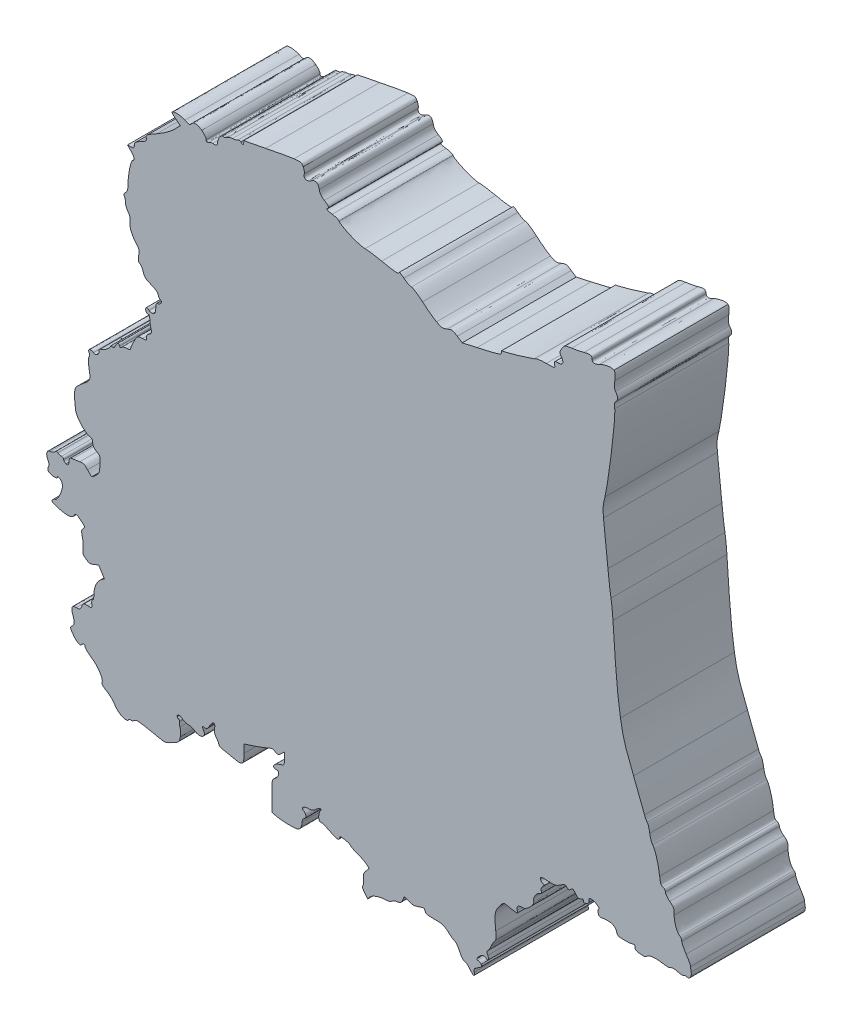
from build123d import *

# Parameters (mm, degrees)
BOSS_EXTRU_7_DEPTH = 5


with BuildPart() as part:
    # Esquisse1 → Boss.-Extru.7 (new body)
    with BuildSketch(Plane(origin=(0, 0, 0), x_dir=(0, 1, 0), z_dir=(0, 0, 1))):
        with BuildLine():
            Line((-281.19316, -2.65401), (-281.31302, -2.55851))
            Line((-281.31302, -2.55851), (-281.14699, -2.42385))
            add(Edge.make_bspline(
                [(-281.14699, -2.42385), (-281.02687, -2.32645), (-280.96172, -2.30516), (-280.91132, -2.34665)],
                knots=[0, 0, 0, 0, 1, 1, 1, 1], degree=3))
            add(Edge.make_bspline(
                [(-280.91132, -2.34665), (-280.87292, -2.37835), (-280.75476, -2.39005), (-280.64853, -2.37285)],
                knots=[0, 0, 0, 0, 1, 1, 1, 1], degree=3))
            add(Edge.make_bspline(
                [(-280.64853, -2.37285), (-280.49438, -2.34795), (-280.42175, -2.37085), (-280.2887, -2.48178)],
                knots=[0, 0, 0, 0, 1, 1, 1, 1], degree=3))
            Line((-280.2887, -2.48178), (-280.12199, -2.62204))
            Line((-280.12199, -2.62204), (-280.0138, -2.49211))
            add(Edge.make_bspline(
                [(-280.0138, -2.49211), (-279.9543, -2.42061), (-279.86541, -2.24404), (-279.81633, -2.09964)],
                knots=[0, 0, 0, 0, 1, 1, 1, 1], degree=3))
            add(Edge.make_bspline(
                [(-279.81633, -2.09964), (-279.76723, -1.95524), (-279.69478, -1.81826), (-279.65538, -1.79526)],
                knots=[0, 0, 0, 0, 1, 1, 1, 1], degree=3))
            add(Edge.make_bspline(
                [(-279.65538, -1.79526), (-279.58588, -1.75466), (-279.50572, -1.33923), (-279.56698, -1.33751)],
                knots=[0, 0, 0, 0, 1, 1, 1, 1], degree=3))
            add(Edge.make_bspline(
                [(-279.56698, -1.33751), (-279.58368, -1.3371), (-279.63058, -1.31561), (-279.67129, -1.28981)],
                knots=[0, 0, 0, 0, 1, 1, 1, 1], degree=3))
            add(Edge.make_bspline(
                [(-279.67129, -1.28981), (-279.72989, -1.25261), (-279.70919, -1.17164), (-279.57073, -0.89752)],
                knots=[0, 0, 0, 0, 1, 1, 1, 1], degree=3))
            add(Edge.make_bspline(
                [(-279.57073, -0.89752), (-279.47483, -0.70749), (-279.409, -0.51896), (-279.4245, -0.47854)],
                knots=[0, 0, 0, 0, 1, 1, 1, 1], degree=3))
            add(Edge.make_bspline(
                [(-279.4245, -0.47854), (-279.4586, -0.38964), (-279.13836, -0.38114), (-279.02884, -0.46794)],
                knots=[0, 0, 0, 0, 1, 1, 1, 1], degree=3))
            add(Edge.make_bspline(
                [(-279.02884, -0.46794), (-278.8864, -0.58098), (-278.89061, -0.44674), (-279.03384, -0.29697)],
                knots=[0, 0, 0, 0, 1, 1, 1, 1], degree=3))
            add(Edge.make_bspline(
                [(-279.03384, -0.29697), (-279.13828, -0.18803), (-279.18199, -0.08367), (-279.18199, 0.05626)],
                knots=[0, 0, 0, 0, 1, 1, 1, 1], degree=3))
            add(Edge.make_bspline(
                [(-279.18199, 0.05626), (-279.18199, 0.26501), (-279.32418, 0.39319), (-279.38371, 0.23807)],
                knots=[0, 0, 0, 0, 1, 1, 1, 1], degree=3))
            add(Edge.make_bspline(
                [(-279.38371, 0.23807), (-279.42461, 0.13124), (-279.61899, 0.13195), (-279.66005, 0.23896)],
                knots=[0, 0, 0, 0, 1, 1, 1, 1], degree=3))
            add(Edge.make_bspline(
                [(-279.66005, 0.23896), (-279.67755, 0.28456), (-279.75835, 0.32206), (-279.8397, 0.32206)],
                knots=[0, 0, 0, 0, 1, 1, 1, 1], degree=3))
            add(Edge.make_bspline(
                [(-279.8397, 0.32206), (-279.9209, 0.32206), (-280.04046, 0.35916), (-280.1052, 0.40456)],
                knots=[0, 0, 0, 0, 1, 1, 1, 1], degree=3))
            add(Edge.make_bspline(
                [(-280.1052, 0.40456), (-280.20666, 0.47566), (-280.22312, 0.54243), (-280.22403, 0.88879)],
                knots=[0, 0, 0, 0, 1, 1, 1, 1], degree=3))
            add(Edge.make_bspline(
                [(-280.22403, 0.88879), (-280.22447, 1.10978), (-280.20023, 1.37153), (-280.16973, 1.47045)],
                knots=[0, 0, 0, 0, 1, 1, 1, 1], degree=3))
            Line((-280.16973, 1.47045), (-280.11423, 1.65032))
            Line((-280.11423, 1.65032), (-279.48845, 1.65032))
            add(Edge.make_bspline(
                [(-279.48845, 1.65032), (-278.89104, 1.65032), (-278.85878, 1.64332), (-278.77668, 1.51907)],
                knots=[0, 0, 0, 0, 1, 1, 1, 1], degree=3))
            add(Edge.make_bspline(
                [(-278.77668, 1.51907), (-278.72938, 1.44697), (-278.62689, 1.37561), (-278.54894, 1.36071)],
                knots=[0, 0, 0, 0, 1, 1, 1, 1], degree=3))
            add(Edge.make_bspline(
                [(-278.54894, 1.36071), (-278.43063, 1.33811), (-278.40721, 1.35371), (-278.40721, 1.45911)],
                knots=[0, 0, 0, 0, 1, 1, 1, 1], degree=3))
            add(Edge.make_bspline(
                [(-278.40721, 1.45911), (-278.40721, 1.6698), (-278.21087, 1.56475), (-278.13569, 1.31375)],
                knots=[0, 0, 0, 0, 1, 1, 1, 1], degree=3))
            add(Edge.make_bspline(
                [(-278.13569, 1.31375), (-278.07229, 1.10205), (-278.06459, 1.09689), (-277.81425, 1.09689)],
                knots=[0, 0, 0, 0, 1, 1, 1, 1], degree=3))
            Line((-277.81425, 1.09689), (-277.55778, 1.09689))
            Line((-277.55778, 1.09689), (-277.68757, 1.23505))
            add(Edge.make_bspline(
                [(-277.68757, 1.23505), (-277.80161, 1.35645), (-277.80886, 1.38908), (-277.74717, 1.50424)],
                knots=[0, 0, 0, 0, 1, 1, 1, 1], degree=3))
            add(Edge.make_bspline(
                [(-277.74717, 1.50424), (-277.68947, 1.61199), (-277.69127, 1.66356), (-277.75747, 1.79496)],
                knots=[0, 0, 0, 0, 1, 1, 1, 1], degree=3))
            add(Edge.make_bspline(
                [(-277.75747, 1.79496), (-277.80187, 1.88286), (-277.90596, 2.16016), (-277.98871, 2.41126)],
                knots=[0, 0, 0, 0, 1, 1, 1, 1], degree=3))
            Line((-277.98871, 2.41126), (-278.13916, 2.86784))
            Line((-278.13916, 2.86784), (-278.48756, 2.86784))
            add(Edge.make_bspline(
                [(-278.48756, 2.86784), (-278.9424, 2.86784), (-278.99888, 2.92914), (-278.90822, 3.32495)],
                knots=[0, 0, 0, 0, 1, 1, 1, 1], degree=3))
            add(Edge.make_bspline(
                [(-278.90822, 3.32495), (-278.87172, 3.48446), (-278.82842, 3.6959), (-278.81192, 3.79482)],
                knots=[0, 0, 0, 0, 1, 1, 1, 1], degree=3))
            add(Edge.make_bspline(
                [(-278.81192, 3.79482), (-278.79542, 3.89362), (-278.75072, 3.97468), (-278.71252, 3.97468)],
                knots=[0, 0, 0, 0, 1, 1, 1, 1], degree=3))
            add(Edge.make_bspline(
                [(-278.71252, 3.97468), (-278.67432, 3.97468), (-278.57988, 4.02428), (-278.50269, 4.08512)],
                knots=[0, 0, 0, 0, 1, 1, 1, 1], degree=3))
            add(Edge.make_bspline(
                [(-278.50269, 4.08512), (-278.40239, 4.16402), (-278.31533, 4.18619), (-278.19755, 4.16262)],
                knots=[0, 0, 0, 0, 1, 1, 1, 1], degree=3))
            add(Edge.make_bspline(
                [(-278.19755, 4.16262), (-277.9428, 4.11172), (-277.9373, 4.22942), (-278.18855, 4.37026)],
                knots=[0, 0, 0, 0, 1, 1, 1, 1], degree=3))
            add(Edge.make_bspline(
                [(-278.18855, 4.37026), (-278.35058, 4.46136), (-278.40677, 4.52474), (-278.38824, 4.59561)],
                knots=[0, 0, 0, 0, 1, 1, 1, 1], degree=3))
            add(Edge.make_bspline(
                [(-278.38824, 4.59561), (-278.35834, 4.7103), (-278.37524, 4.71535), (-278.52528, 4.63511)],
                knots=[0, 0, 0, 0, 1, 1, 1, 1], degree=3))
            add(Edge.make_bspline(
                [(-278.52528, 4.63511), (-278.75065, 4.51448), (-278.88575, 4.81846), (-278.71004, 5.05077)],
                knots=[0, 0, 0, 0, 1, 1, 1, 1], degree=3))
            add(Edge.make_bspline(
                [(-278.71004, 5.05077), (-278.66534, 5.10987), (-278.62874, 5.22339), (-278.62874, 5.30307)],
                knots=[0, 0, 0, 0, 1, 1, 1, 1], degree=3))
            add(Edge.make_bspline(
                [(-278.62874, 5.30307), (-278.62874, 5.38277), (-278.59214, 5.49628), (-278.54754, 5.55536)],
                knots=[0, 0, 0, 0, 1, 1, 1, 1], degree=3))
            add(Edge.make_bspline(
                [(-278.54754, 5.55536), (-278.44206, 5.69489), (-278.44128, 5.80114), (-278.54654, 5.80114)],
                knots=[0, 0, 0, 0, 1, 1, 1, 1], degree=3))
            add(Edge.make_bspline(
                [(-278.54654, 5.80114), (-278.59214, 5.80114), (-278.62964, 5.77404), (-278.62964, 5.74114)],
                knots=[0, 0, 0, 0, 1, 1, 1, 1], degree=3))
            add(Edge.make_bspline(
                [(-278.62964, 5.74114), (-278.62964, 5.70824), (-278.66074, 5.69214), (-278.69884, 5.70554)],
                knots=[0, 0, 0, 0, 1, 1, 1, 1], degree=3))
            add(Edge.make_bspline(
                [(-278.69884, 5.70554), (-278.73694, 5.71894), (-278.82816, 5.70754), (-278.90151, 5.68044)],
                knots=[0, 0, 0, 0, 1, 1, 1, 1], degree=3))
            add(Edge.make_bspline(
                [(-278.90151, 5.68044), (-278.97501, 5.65324), (-279.13847, 5.64644), (-279.26491, 5.66554)],
                knots=[0, 0, 0, 0, 1, 1, 1, 1], degree=3))
            add(Edge.make_bspline(
                [(-279.26491, 5.66554), (-279.47599, 5.69724), (-279.50859, 5.72564), (-279.66285, 6.01348)],
                knots=[0, 0, 0, 0, 1, 1, 1, 1], degree=3))
            add(Edge.make_bspline(
                [(-279.66285, 6.01348), (-279.80661, 6.28162), (-279.82365, 6.35494), (-279.78077, 6.52065)],
                knots=[0, 0, 0, 0, 1, 1, 1, 1], degree=3))
            add(Edge.make_bspline(
                [(-279.78077, 6.52065), (-279.75317, 6.62711), (-279.69577, 6.91284), (-279.65301, 7.15547)],
                knots=[0, 0, 0, 0, 1, 1, 1, 1], degree=3))
            add(Edge.make_bspline(
                [(-279.65301, 7.15547), (-279.58391, 7.54795), (-279.58481, 7.60707), (-279.66101, 7.69158)],
                knots=[0, 0, 0, 0, 1, 1, 1, 1], degree=3))
            add(Edge.make_bspline(
                [(-279.66101, 7.69158), (-279.70831, 7.74378), (-279.73151, 7.81143), (-279.71271, 7.84195)],
                knots=[0, 0, 0, 0, 1, 1, 1, 1], degree=3))
            add(Edge.make_bspline(
                [(-279.71271, 7.84195), (-279.69391, 7.87235), (-279.71671, 7.91865), (-279.76271, 7.94454)],
                knots=[0, 0, 0, 0, 1, 1, 1, 1], degree=3))
            add(Edge.make_bspline(
                [(-279.76271, 7.94454), (-279.90207, 8.02244), (-279.71881, 8.41195), (-279.4829, 8.53898)],
                knots=[0, 0, 0, 0, 1, 1, 1, 1], degree=3))
            add(Edge.make_bspline(
                [(-279.4829, 8.53898), (-279.37885, 8.59488), (-279.22974, 8.75014), (-279.15142, 8.88378)],
                knots=[0, 0, 0, 0, 1, 1, 1, 1], degree=3))
            add(Edge.make_bspline(
                [(-279.15142, 8.88378), (-279.04787, 9.06051), (-278.98309, 9.11851), (-278.91389, 9.09654)],
                knots=[0, 0, 0, 0, 1, 1, 1, 1], degree=3))
            add(Edge.make_bspline(
                [(-278.91389, 9.09654), (-278.74645, 9.04344), (-278.40258, 9.26941), (-278.20541, 9.5622)],
                knots=[0, 0, 0, 0, 1, 1, 1, 1], degree=3))
            add(Edge.make_bspline(
                [(-278.20541, 9.5622), (-278.10213, 9.71561), (-277.98086, 9.84115), (-277.93601, 9.84115)],
                knots=[0, 0, 0, 0, 1, 1, 1, 1], degree=3))
            add(Edge.make_bspline(
                [(-277.93601, 9.84115), (-277.84321, 9.84115), (-277.82678, 9.92815), (-277.90981, 9.97951)],
                knots=[0, 0, 0, 0, 1, 1, 1, 1], degree=3))
            add(Edge.make_bspline(
                [(-277.90981, 9.97951), (-278.02501, 10.05061), (-277.95491, 10.20642), (-277.73926, 10.35905)],
                knots=[0, 0, 0, 0, 1, 1, 1, 1], degree=3))
            add(Edge.make_bspline(
                [(-277.73926, 10.35905), (-277.54539, 10.49625), (-277.507, 10.50627), (-277.44989, 10.43465)],
                knots=[0, 0, 0, 0, 1, 1, 1, 1], degree=3))
            add(Edge.make_bspline(
                [(-277.44989, 10.43465), (-277.34881, 10.30778), (-277.23804, 10.29352), (-276.99915, 10.37655)],
                knots=[0, 0, 0, 0, 1, 1, 1, 1], degree=3))
            add(Edge.make_bspline(
                [(-276.99915, 10.37655), (-276.71922, 10.47405), (-276.63695, 10.43975), (-276.63695, 10.22529)],
                knots=[0, 0, 0, 0, 1, 1, 1, 1], degree=3))
            add(Edge.make_bspline(
                [(-276.63695, 10.22529), (-276.63695, 10.08367), (-276.60665, 10.04127), (-276.46784, 9.98886)],
                knots=[0, 0, 0, 0, 1, 1, 1, 1], degree=3))
            add(Edge.make_bspline(
                [(-276.46784, 9.98886), (-276.3183, 9.93246), (-276.30049, 9.90256), (-276.31409, 9.73081)],
                knots=[0, 0, 0, 0, 1, 1, 1, 1], degree=3))
            add(Edge.make_bspline(
                [(-276.31409, 9.73081), (-276.32899, 9.54328), (-276.32309, 9.53706), (-276.15115, 9.55062)],
                knots=[0, 0, 0, 0, 1, 1, 1, 1], degree=3))
            add(Edge.make_bspline(
                [(-276.15115, 9.55062), (-276.05305, 9.55862), (-275.97285, 9.54002), (-275.97285, 9.50922)],
                knots=[0, 0, 0, 0, 1, 1, 1, 1], degree=3))
            add(Edge.make_bspline(
                [(-275.97285, 9.50922), (-275.97285, 9.47872), (-275.85753, 9.45362), (-275.71651, 9.45362)],
                knots=[0, 0, 0, 0, 1, 1, 1, 1], degree=3))
            add(Edge.make_bspline(
                [(-275.71651, 9.45362), (-275.4431, 9.45362), (-275.14874, 9.31089), (-275.00813, 9.11015)],
                knots=[0, 0, 0, 0, 1, 1, 1, 1], degree=3))
            Line((-275.00813, 9.11015), (-274.92893, 8.99711))
            Line((-274.92893, 8.99711), (-274.73142, 9.11917))
            add(Edge.make_bspline(
                [(-274.73142, 9.11917), (-274.62283, 9.18617), (-274.5339, 9.24878), (-274.5339, 9.25804)],
                knots=[0, 0, 0, 0, 1, 1, 1, 1], degree=3))
            add(Edge.make_bspline(
                [(-274.5339, 9.25804), (-274.5339, 9.26704), (-274.5689, 9.35808), (-274.6117, 9.45986)],
                knots=[0, 0, 0, 0, 1, 1, 1, 1], degree=3))
            add(Edge.make_bspline(
                [(-274.6117, 9.45986), (-274.6827, 9.62882), (-274.6797, 9.65866), (-274.5761, 9.8042)],
                knots=[0, 0, 0, 0, 1, 1, 1, 1], degree=3))
            add(Edge.make_bspline(
                [(-274.5761, 9.8042), (-274.4774, 9.94292), (-274.43727, 9.95943), (-274.26661, 9.9317)],
                knots=[0, 0, 0, 0, 1, 1, 1, 1], degree=3))
            add(Edge.make_bspline(
                [(-274.26661, 9.9317), (-274.1588, 9.9142), (-273.962394, 9.9277), (-273.830144, 9.9605)],
                knots=[0, 0, 0, 0, 1, 1, 1, 1], degree=3))
            add(Edge.make_bspline(
                [(-273.830144, 9.9605), (-273.626521, 10.0119), (-273.574067, 10.007), (-273.487634, 9.9286)],
                knots=[0, 0, 0, 0, 1, 1, 1, 1], degree=3))
            add(Edge.make_bspline(
                [(-273.487634, 9.9286), (-273.391344, 9.8413), (-273.377493, 9.8459), (-273.240329, 10.0089)],
                knots=[0, 0, 0, 0, 1, 1, 1, 1], degree=3))
            add(Edge.make_bspline(
                [(-273.240329, 10.0089), (-273.065976, 10.21612), (-273.061209, 10.26169), (-273.205719, 10.33905)],
                knots=[0, 0, 0, 0, 1, 1, 1, 1], degree=3))
            add(Edge.make_bspline(
                [(-273.205719, 10.33905), (-273.344773, 10.41345), (-273.353482, 10.7086), (-273.227499, 11.07823)],
                knots=[0, 0, 0, 0, 1, 1, 1, 1], degree=3))
            add(Edge.make_bspline(
                [(-273.227499, 11.07823), (-273.155069, 11.29073), (-273.124356, 11.32718), (-273.061481, 11.27499)],
                knots=[0, 0, 0, 0, 1, 1, 1, 1], degree=3))
            add(Edge.make_bspline(
                [(-273.061481, 11.27499), (-273.018971, 11.23979), (-272.984251, 11.18149), (-272.984251, 11.14581)],
                knots=[0, 0, 0, 0, 1, 1, 1, 1], degree=3))
            add(Edge.make_bspline(
                [(-272.984251, 11.14581), (-272.984251, 11.05461), (-272.516825, 10.83718), (-272.320614, 10.83718)],
                knots=[0, 0, 0, 0, 1, 1, 1, 1], degree=3))
            add(Edge.make_bspline(
                [(-272.320614, 10.83718), (-272.214612, 10.83718), (-272.137387, 10.87578), (-272.098785, 10.94787)],
                knots=[0, 0, 0, 0, 1, 1, 1, 1], degree=3))
            add(Edge.make_bspline(
                [(-272.098785, 10.94787), (-272.058615, 11.02297), (-272.057965, 11.05856), (-272.097585, 11.05856)],
                knots=[0, 0, 0, 0, 1, 1, 1, 1], degree=3))
            add(Edge.make_bspline(
                [(-272.097585, 11.05856), (-272.184405, 11.05856), (-272.166135, 11.36774), (-272.074775, 11.44355)],
                knots=[0, 0, 0, 0, 1, 1, 1, 1], degree=3))
            add(Edge.make_bspline(
                [(-272.074775, 11.44355), (-272.019315, 11.48955), (-271.964505, 11.49315), (-271.896627, 11.45525)],
                knots=[0, 0, 0, 0, 1, 1, 1, 1], degree=3))
            add(Edge.make_bspline(
                [(-271.896627, 11.45525), (-271.828077, 11.41695), (-271.754865, 11.42295), (-271.653169, 11.47565)],
                knots=[0, 0, 0, 0, 1, 1, 1, 1], degree=3))
            add(Edge.make_bspline(
                [(-271.653169, 11.47565), (-271.456102, 11.57771), (-271.269416, 11.52285), (-271.269416, 11.36343)],
                knots=[0, 0, 0, 0, 1, 1, 1, 1], degree=3))
            add(Edge.make_bspline(
                [(-271.269416, 11.36343), (-271.269416, 11.29453), (-271.230936, 11.20642), (-271.184026, 11.16746)],
                knots=[0, 0, 0, 0, 1, 1, 1, 1], degree=3))
            add(Edge.make_bspline(
                [(-271.184026, 11.16746), (-271.124816, 11.11836), (-271.116386, 11.07886), (-271.156296, 11.03892)],
                knots=[0, 0, 0, 0, 1, 1, 1, 1], degree=3))
            add(Edge.make_bspline(
                [(-271.156296, 11.03892), (-271.188036, 11.00712), (-271.213956, 10.93644), (-271.213956, 10.88162)],
                knots=[0, 0, 0, 0, 1, 1, 1, 1], degree=3))
            add(Edge.make_bspline(
                [(-271.213956, 10.88162), (-271.213956, 10.82672), (-271.248436, 10.78202), (-271.290546, 10.78202)],
                knots=[0, 0, 0, 0, 1, 1, 1, 1], degree=3))
            add(Edge.make_bspline(
                [(-271.290546, 10.78202), (-271.332666, 10.78202), (-271.379836, 10.73362), (-271.39524, 10.67438)],
                knots=[0, 0, 0, 0, 1, 1, 1, 1], degree=3))
            add(Edge.make_bspline(
                [(-271.39524, 10.67438), (-271.41817, 10.58668), (-271.39134, 10.56357), (-271.249512, 10.54985)],
                knots=[0, 0, 0, 0, 1, 1, 1, 1], degree=3))
            add(Edge.make_bspline(
                [(-271.249512, 10.54985), (-271.10836, 10.53615), (-271.073958, 10.50695), (-271.06678, 10.39459)],
                knots=[0, 0, 0, 0, 1, 1, 1, 1], degree=3))
            add(Edge.make_bspline(
                [(-271.06678, 10.39459), (-271.06158, 10.31849), (-271.04022, 10.17568), (-271.01858, 10.07722)],
                knots=[0, 0, 0, 0, 1, 1, 1, 1], degree=3))
            add(Edge.make_bspline(
                [(-271.01858, 10.07722), (-270.98451, 9.92244), (-271.00264, 9.87635), (-271.151958, 9.7368)],
                knots=[0, 0, 0, 0, 1, 1, 1, 1], degree=3))
            add(Edge.make_bspline(
                [(-271.151958, 9.7368), (-271.246938, 9.648), (-271.324728, 9.56414), (-271.324728, 9.55034)],
                knots=[0, 0, 0, 0, 1, 1, 1, 1], degree=3))
            add(Edge.make_bspline(
                [(-271.324728, 9.55034), (-271.324728, 9.53664), (-271.258778, 9.45404), (-271.178135, 9.36712)],
                knots=[0, 0, 0, 0, 1, 1, 1, 1], degree=3))
            add(Edge.make_bspline(
                [(-271.178135, 9.36712), (-271.053994, 9.23313), (-270.979875, 9.20572), (-270.693902, 9.18794)],
                knots=[0, 0, 0, 0, 1, 1, 1, 1], degree=3))
            add(Edge.make_bspline(
                [(-270.693902, 9.18794), (-270.365963, 9.16734), (-270.353358, 9.17184), (-270.256266, 9.33801)],
                knots=[0, 0, 0, 0, 1, 1, 1, 1], degree=3))
            add(Edge.make_bspline(
                [(-270.256266, 9.33801), (-270.183226, 9.46306), (-270.115615, 9.50913), (-270.005156, 9.50913)],
                knots=[0, 0, 0, 0, 1, 1, 1, 1], degree=3))
            add(Edge.make_bspline(
                [(-270.005156, 9.50913), (-269.890016, 9.50913), (-269.851906, 9.53763), (-269.845046, 9.62874)],
                knots=[0, 0, 0, 0, 1, 1, 1, 1], degree=3))
            add(Edge.make_bspline(
                [(-269.845046, 9.62874), (-269.830746, 9.81878), (-269.407656, 10.21226), (-269.173917, 10.25296)],
                knots=[0, 0, 0, 0, 1, 1, 1, 1], degree=3))
            add(Edge.make_bspline(
                [(-269.173917, 10.25296), (-268.788787, 10.31986), (-268.418517, 10.32416), (-268.300697, 10.26356)],
                knots=[0, 0, 0, 0, 1, 1, 1, 1], degree=3))
            add(Edge.make_bspline(
                [(-268.300697, 10.26356), (-268.235497, 10.22956), (-268.079267, 10.07099), (-267.953537, 9.9112)],
                knots=[0, 0, 0, 0, 1, 1, 1, 1], degree=3))
            add(Edge.make_bspline(
                [(-267.953537, 9.9112), (-267.709037, 9.60045), (-267.679197, 9.59069), (-267.232317, 9.67545)],
                knots=[0, 0, 0, 0, 1, 1, 1, 1], degree=3))
            add(Edge.make_bspline(
                [(-267.232317, 9.67545), (-267.034007, 9.71305), (-266.909017, 9.71165), (-266.833827, 9.67245)],
                knots=[0, 0, 0, 0, 1, 1, 1, 1], degree=3))
            add(Edge.make_bspline(
                [(-266.833827, 9.67245), (-266.756127, 9.63095), (-266.703087, 9.63145), (-266.651257, 9.67342)],
                knots=[0, 0, 0, 0, 1, 1, 1, 1], degree=3))
            add(Edge.make_bspline(
                [(-266.651257, 9.67342), (-266.553257, 9.75482), (-266.483017, 9.58132), (-266.571057, 9.47513)],
                knots=[0, 0, 0, 0, 1, 1, 1, 1], degree=3))
            add(Edge.make_bspline(
                [(-266.571057, 9.47513), (-266.651257, 9.37863), (-266.543857, 9.23311), (-266.392427, 9.23311)],
                knots=[0, 0, 0, 0, 1, 1, 1, 1], degree=3))
            add(Edge.make_bspline(
                [(-266.392427, 9.23311), (-266.335327, 9.23311), (-266.288557, 9.20351), (-266.288557, 9.16751)],
                knots=[0, 0, 0, 0, 1, 1, 1, 1], degree=3))
            add(Edge.make_bspline(
                [(-266.288557, 9.16751), (-266.288557, 9.06513), (-266.047417, 8.73596), (-265.972087, 8.73554)],
                knots=[0, 0, 0, 0, 1, 1, 1, 1], degree=3))
            add(Edge.make_bspline(
                [(-265.972087, 8.73554), (-265.934987, 8.73533), (-265.918787, 8.69834), (-265.936187, 8.65324)],
                knots=[0, 0, 0, 0, 1, 1, 1, 1], degree=3))
            add(Edge.make_bspline(
                [(-265.936187, 8.65324), (-265.956287, 8.60104), (-265.915687, 8.54789), (-265.823737, 8.50601)],
                knots=[0, 0, 0, 0, 1, 1, 1, 1], degree=3))
            add(Edge.make_bspline(
                [(-265.823737, 8.50601), (-265.667507, 8.43481), (-265.640357, 8.37128), (-265.748937, 8.33143)],
                knots=[0, 0, 0, 0, 1, 1, 1, 1], degree=3))
            add(Edge.make_bspline(
                [(-265.748937, 8.33143), (-265.804237, 8.31123), (-265.804237, 8.29133), (-265.748937, 8.23273)],
                knots=[0, 0, 0, 0, 1, 1, 1, 1], degree=3))
            add(Edge.make_bspline(
                [(-265.748937, 8.23273), (-265.710737, 8.19233), (-265.679737, 8.08967), (-265.679737, 8.00446)],
                knots=[0, 0, 0, 0, 1, 1, 1, 1], degree=3))
            add(Edge.make_bspline(
                [(-265.679737, 8.00446), (-265.679737, 7.91836), (-265.649437, 7.84949), (-265.611437, 7.84949)],
                knots=[0, 0, 0, 0, 1, 1, 1, 1], degree=3))
            add(Edge.make_bspline(
                [(-265.611437, 7.84949), (-265.573837, 7.84949), (-265.412047, 7.78089), (-265.251847, 7.6973)],
                knots=[0, 0, 0, 0, 1, 1, 1, 1], degree=3))
            add(Edge.make_bspline(
                [(-265.251847, 7.6973), (-264.976877, 7.55363), (-264.960547, 7.53313), (-264.960437, 7.33112)],
                knots=[0, 0, 0, 0, 1, 1, 1, 1], degree=3))
            add(Edge.make_bspline(
                [(-264.960437, 7.33112), (-264.960317, 7.14609), (-264.945737, 7.12096), (-264.852087, 7.14542)],
                knots=[0, 0, 0, 0, 1, 1, 1, 1], degree=3))
            add(Edge.make_bspline(
                [(-264.852087, 7.14542), (-264.778587, 7.16452), (-264.715517, 7.13032), (-264.655307, 7.03835)],
                knots=[0, 0, 0, 0, 1, 1, 1, 1], degree=3))
            add(Edge.make_bspline(
                [(-264.655307, 7.03835), (-264.588607, 6.93638), (-264.537387, 6.9124), (-264.447757, 6.94085)],
                knots=[0, 0, 0, 0, 1, 1, 1, 1], degree=3))
            add(Edge.make_bspline(
                [(-264.447757, 6.94085), (-264.348257, 6.97255), (-264.203917, 6.99405), (-263.950227, 7.01585)],
                knots=[0, 0, 0, 0, 1, 1, 1, 1], degree=3))
            add(Edge.make_bspline(
                [(-263.950227, 7.01585), (-263.927227, 7.01681), (-263.908827, 7.05675), (-263.908827, 7.10235)],
                knots=[0, 0, 0, 0, 1, 1, 1, 1], degree=3))
            add(Edge.make_bspline(
                [(-263.908827, 7.10235), (-263.908827, 7.14855), (-263.859527, 7.18545), (-263.798127, 7.18545)],
                knots=[0, 0, 0, 0, 1, 1, 1, 1], degree=3))
            add(Edge.make_bspline(
                [(-263.798127, 7.18545), (-263.675017, 7.18545), (-263.656027, 7.12835), (-263.748227, 7.03605)],
                knots=[0, 0, 0, 0, 1, 1, 1, 1], degree=3))
            add(Edge.make_bspline(
                [(-263.748227, 7.03605), (-263.781627, 7.00265), (-263.792427, 6.92291), (-263.772227, 6.85898)],
                knots=[0, 0, 0, 0, 1, 1, 1, 1], degree=3))
            add(Edge.make_bspline(
                [(-263.772227, 6.85898), (-263.742827, 6.76678), (-263.690127, 6.74276), (-263.517677, 6.74276)],
                knots=[0, 0, 0, 0, 1, 1, 1, 1], degree=3))
            add(Edge.make_bspline(
                [(-263.517677, 6.74276), (-263.369707, 6.74276), (-263.300047, 6.71846), (-263.300047, 6.66656)],
                knots=[0, 0, 0, 0, 1, 1, 1, 1], degree=3))
            add(Edge.make_bspline(
                [(-263.300047, 6.66656), (-263.300047, 6.62456), (-263.264647, 6.56092), (-263.221647, 6.52515)],
                knots=[0, 0, 0, 0, 1, 1, 1, 1], degree=3))
            add(Edge.make_bspline(
                [(-263.221647, 6.52515), (-263.160447, 6.47435), (-263.132947, 6.47755), (-263.097127, 6.53985)],
                knots=[0, 0, 0, 0, 1, 1, 1, 1], degree=3))
            add(Edge.make_bspline(
                [(-263.097127, 6.53985), (-263.072027, 6.58385), (-263.002227, 6.62895), (-262.942267, 6.6401)],
                knots=[0, 0, 0, 0, 1, 1, 1, 1], degree=3))
            add(Edge.make_bspline(
                [(-262.942267, 6.6401), (-262.870267, 6.6536), (-262.796077, 6.75699), (-262.723327, 6.94528)],
                knots=[0, 0, 0, 0, 1, 1, 1, 1], degree=3))
            add(Edge.make_bspline(
                [(-262.723327, 6.94528), (-262.628627, 7.19012), (-262.584677, 7.23866), (-262.409057, 7.29127)],
                knots=[0, 0, 0, 0, 1, 1, 1, 1], degree=3))
            add(Edge.make_bspline(
                [(-262.409057, 7.29127), (-262.296737, 7.32497), (-262.189517, 7.39243), (-262.170787, 7.44116)],
                knots=[0, 0, 0, 0, 1, 1, 1, 1], degree=3))
            add(Edge.make_bspline(
                [(-262.170787, 7.44116), (-262.143487, 7.51236), (-262.088187, 7.52256), (-261.889497, 7.49276)],
                knots=[0, 0, 0, 0, 1, 1, 1, 1], degree=3))
            add(Edge.make_bspline(
                [(-261.889497, 7.49276), (-261.681717, 7.46176), (-261.622157, 7.47456), (-261.516557, 7.57436)],
                knots=[0, 0, 0, 0, 1, 1, 1, 1], degree=3))
            add(Edge.make_bspline(
                [(-261.516557, 7.57436), (-261.293467, 7.78512), (-260.988057, 7.91212), (-260.792497, 7.87543)],
                knots=[0, 0, 0, 0, 1, 1, 1, 1], degree=3))
            add(Edge.make_bspline(
                [(-260.792497, 7.87543), (-260.658917, 7.85043), (-260.575987, 7.87243), (-260.467547, 7.95633)],
                knots=[0, 0, 0, 0, 1, 1, 1, 1], degree=3))
            add(Edge.make_bspline(
                [(-260.467547, 7.95633), (-260.387347, 8.01933), (-260.249907, 8.0709), (-260.161877, 8.0709)],
                knots=[0, 0, 0, 0, 1, 1, 1, 1], degree=3))
            add(Edge.make_bspline(
                [(-260.161877, 8.0709), (-260.073877, 8.0709), (-259.976317, 8.0964), (-259.945157, 8.1276)],
                knots=[0, 0, 0, 0, 1, 1, 1, 1], degree=3))
            add(Edge.make_bspline(
                [(-259.945157, 8.1276), (-259.906557, 8.1662), (-259.856257, 8.1486), (-259.787157, 8.0722)],
                knots=[0, 0, 0, 0, 1, 1, 1, 1], degree=3))
            add(Edge.make_bspline(
                [(-259.787157, 8.0722), (-259.714057, 7.9912), (-259.616497, 7.96023), (-259.436047, 7.96023)],
                knots=[0, 0, 0, 0, 1, 1, 1, 1], degree=3))
            add(Edge.make_bspline(
                [(-259.436047, 7.96023), (-259.054047, 7.96023), (-258.463077, 7.84413), (-258.413517, 7.75925)],
                knots=[0, 0, 0, 0, 1, 1, 1, 1], degree=3))
            add(Edge.make_bspline(
                [(-258.413517, 7.75925), (-258.347917, 7.6468), (-258.260357, 7.66635), (-258.087237, 7.83215)],
                knots=[0, 0, 0, 0, 1, 1, 1, 1], degree=3))
            Line((-258.087237, 7.83215), (-257.932027, 7.98086))
            Line((-257.932027, 7.98086), (-257.932027, 7.83215))
            add(Edge.make_bspline(
                [(-257.932027, 7.83215), (-257.932027, 7.71073), (-257.907027, 7.68343), (-257.794607, 7.68343)],
                knots=[0, 0, 0, 0, 1, 1, 1, 1], degree=3))
            add(Edge.make_bspline(
                [(-257.794607, 7.68343), (-257.685197, 7.68343), (-257.628477, 7.62673), (-257.516597, 7.40599)],
                knots=[0, 0, 0, 0, 1, 1, 1, 1], degree=3))
            add(Edge.make_bspline(
                [(-257.516597, 7.40599), (-257.398547, 7.17309), (-257.356237, 7.13322), (-257.252787, 7.15759)],
                knots=[0, 0, 0, 0, 1, 1, 1, 1], degree=3))
            add(Edge.make_bspline(
                [(-257.252787, 7.15759), (-257.145267, 7.18299), (-257.095537, 7.12399), (-256.862297, 6.69535)],
                knots=[0, 0, 0, 0, 1, 1, 1, 1], degree=3))
            add(Edge.make_bspline(
                [(-256.862297, 6.69535), (-256.711427, 6.41801), (-256.475687, 6.08649), (-256.320907, 5.93406)],
                knots=[0, 0, 0, 0, 1, 1, 1, 1], degree=3))
            Line((-256.320907, 5.93406), (-256.046757, 5.66402))
            Line((-256.046757, 5.66402), (-255.906217, 5.84359))
            add(Edge.make_bspline(
                [(-255.906217, 5.84359), (-255.828817, 5.94229), (-255.744127, 6.02318), (-255.717847, 6.02318)],
                knots=[0, 0, 0, 0, 1, 1, 1, 1], degree=3))
            add(Edge.make_bspline(
                [(-255.717847, 6.02318), (-255.626147, 6.02318), (-255.633647, 5.66191), (-255.729547, 5.46134)],
                knots=[0, 0, 0, 0, 1, 1, 1, 1], degree=3))
            add(Edge.make_bspline(
                [(-255.729547, 5.46134), (-255.812947, 5.28694), (-255.815147, 5.25021), (-255.746847, 5.19346)],
                knots=[0, 0, 0, 0, 1, 1, 1, 1], degree=3))
            add(Edge.make_bspline(
                [(-255.746847, 5.19346), (-255.595147, 5.0675), (-255.595907, 4.92478), (-255.748847, 4.72349)],
                knots=[0, 0, 0, 0, 1, 1, 1, 1], degree=3))
            add(Edge.make_bspline(
                [(-255.748847, 4.72349), (-255.830447, 4.61643), (-255.944957, 4.52893), (-256.003307, 4.52893)],
                knots=[0, 0, 0, 0, 1, 1, 1, 1], degree=3))
            add(Edge.make_bspline(
                [(-256.003307, 4.52893), (-256.092407, 4.52893), (-256.099807, 4.51123), (-256.049907, 4.41767)],
                knots=[0, 0, 0, 0, 1, 1, 1, 1], degree=3))
            add(Edge.make_bspline(
                [(-256.049907, 4.41767), (-256.017107, 4.35637), (-255.994407, 4.27551), (-255.999107, 4.23782)],
                knots=[0, 0, 0, 0, 1, 1, 1, 1], degree=3))
            add(Edge.make_bspline(
                [(-255.999107, 4.23782), (-256.019207, 4.08062), (-255.987407, 4.0309), (-255.868787, 4.0309)],
                knots=[0, 0, 0, 0, 1, 1, 1, 1], degree=3))
            add(Edge.make_bspline(
                [(-255.868787, 4.0309), (-255.704107, 4.0309), (-255.481687, 3.87326), (-255.516887, 3.78149)],
                knots=[0, 0, 0, 0, 1, 1, 1, 1], degree=3))
            add(Edge.make_bspline(
                [(-255.516887, 3.78149), (-255.532087, 3.74199), (-255.508887, 3.66357), (-255.467087, 3.60737)],
                knots=[0, 0, 0, 0, 1, 1, 1, 1], degree=3))
            add(Edge.make_bspline(
                [(-255.467087, 3.60737), (-255.424487, 3.55117), (-255.388987, 3.44748), (-255.387987, 3.37699)],
                knots=[0, 0, 0, 0, 1, 1, 1, 1], degree=3))
            add(Edge.make_bspline(
                [(-255.387987, 3.37699), (-255.387117, 3.30649), (-255.361287, 3.20217), (-255.330687, 3.14514)],
                knots=[0, 0, 0, 0, 1, 1, 1, 1], degree=3))
            add(Edge.make_bspline(
                [(-255.330687, 3.14514), (-255.293587, 3.07574), (-255.293587, 3.0301), (-255.330687, 3.00716)],
                knots=[0, 0, 0, 0, 1, 1, 1, 1], degree=3))
            add(Edge.make_bspline(
                [(-255.330687, 3.00716), (-255.418187, 2.95316), (-255.395487, 2.86864), (-255.303187, 2.90393)],
                knots=[0, 0, 0, 0, 1, 1, 1, 1], degree=3))
            add(Edge.make_bspline(
                [(-255.303187, 2.90393), (-255.257587, 2.92143), (-255.220087, 2.91193), (-255.220087, 2.88253)],
                knots=[0, 0, 0, 0, 1, 1, 1, 1], degree=3))
            add(Edge.make_bspline(
                [(-255.220087, 2.88253), (-255.220087, 2.85313), (-255.135887, 2.42099), (-255.032587, 1.92197)],
                knots=[0, 0, 0, 0, 1, 1, 1, 1], degree=3))
            add(Edge.make_bspline(
                [(-255.032587, 1.92197), (-254.929357, 1.423), (-254.828017, 0.86424), (-254.807127, 0.68034)],
                knots=[0, 0, 0, 0, 1, 1, 1, 1], degree=3))
            add(Edge.make_bspline(
                [(-254.807127, 0.68034), (-254.771127, 0.36222), (-254.775927, 0.3424), (-254.907897, 0.27173)],
                knots=[0, 0, 0, 0, 1, 1, 1, 1], degree=3))
            add(Edge.make_bspline(
                [(-254.907897, 0.27173), (-254.984197, 0.23083), (-255.098217, 0.21093), (-255.161157, 0.22733)],
                knots=[0, 0, 0, 0, 1, 1, 1, 1], degree=3))
            add(Edge.make_bspline(
                [(-255.161157, 0.22733), (-255.338837, 0.27383), (-255.398967, 0.10913), (-255.270207, -0.07159)],
                knots=[0, 0, 0, 0, 1, 1, 1, 1], degree=3))
            add(Edge.make_bspline(
                [(-255.270207, -0.07159), (-255.133317, -0.26383), (-255.183507, -0.38468), (-255.418157, -0.42873)],
                knots=[0, 0, 0, 0, 1, 1, 1, 1], degree=3))
            add(Edge.make_bspline(
                [(-255.418157, -0.42873), (-255.551167, -0.45363), (-255.639427, -0.51843), (-255.721697, -0.6516)],
                knots=[0, 0, 0, 0, 1, 1, 1, 1], degree=3))
            add(Edge.make_bspline(
                [(-255.721697, -0.6516), (-255.846617, -0.8538), (-255.884117, -0.87241), (-255.977737, -0.77873)],
                knots=[0, 0, 0, 0, 1, 1, 1, 1], degree=3))
            add(Edge.make_bspline(
                [(-255.977737, -0.77873), (-256.021537, -0.73483), (-256.048737, -0.79493), (-256.076437, -0.99596)],
                knots=[0, 0, 0, 0, 1, 1, 1, 1], degree=3))
            add(Edge.make_bspline(
                [(-256.076437, -0.99596), (-256.097437, -1.14872), (-256.145937, -1.28574), (-256.184537, -1.3005)],
                knots=[0, 0, 0, 0, 1, 1, 1, 1], degree=3))
            add(Edge.make_bspline(
                [(-256.184537, -1.3005), (-256.320407, -1.3526), (-256.669967, -2.17915), (-256.666137, -2.43918)],
                knots=[0, 0, 0, 0, 1, 1, 1, 1], degree=3))
            add(Edge.make_bspline(
                [(-256.666137, -2.43918), (-256.664137, -2.57342), (-256.711537, -2.90313), (-256.771277, -3.17187)],
                knots=[0, 0, 0, 0, 1, 1, 1, 1], degree=3))
            add(Edge.make_bspline(
                [(-256.771277, -3.17187), (-256.893847, -3.72195), (-256.907767, -3.93841), (-256.820777, -3.93841)],
                knots=[0, 0, 0, 0, 1, 1, 1, 1], degree=3))
            add(Edge.make_bspline(
                [(-256.820777, -3.93841), (-256.788077, -3.93841), (-256.837877, -4.03131), (-256.931457, -4.14472)],
                knots=[0, 0, 0, 0, 1, 1, 1, 1], degree=3))
            add(Edge.make_bspline(
                [(-256.931457, -4.14472), (-257.025157, -4.25821), (-257.101517, -4.40617), (-257.101517, -4.47357)],
                knots=[0, 0, 0, 0, 1, 1, 1, 1], degree=3))
            add(Edge.make_bspline(
                [(-257.101517, -4.47357), (-257.101517, -4.54377), (-257.238227, -4.75248), (-257.421397, -4.962)],
                knots=[0, 0, 0, 0, 1, 1, 1, 1], degree=3))
            add(Edge.make_bspline(
                [(-257.421397, -4.962), (-257.597337, -5.16322), (-257.800217, -5.43896), (-257.872237, -5.5747)],
                knots=[0, 0, 0, 0, 1, 1, 1, 1], degree=3))
            add(Edge.make_bspline(
                [(-257.872237, -5.5747), (-257.998457, -5.81263), (-257.999997, -5.8297), (-257.914537, -6.04713)],
                knots=[0, 0, 0, 0, 1, 1, 1, 1], degree=3))
            add(Edge.make_bspline(
                [(-257.914537, -6.04713), (-257.827937, -6.26744), (-257.829237, -6.27771), (-257.967937, -6.48734)],
                knots=[0, 0, 0, 0, 1, 1, 1, 1], degree=3))
            Line((-257.967937, -6.48734), (-258.109987, -6.702))
            Line((-258.109987, -6.702), (-257.964877, -7.35402))
            add(Edge.make_bspline(
                [(-257.964877, -7.35402), (-257.755927, -8.29295), (-257.715057, -8.42111), (-257.624597, -8.42111)],
                knots=[0, 0, 0, 0, 1, 1, 1, 1], degree=3))
            add(Edge.make_bspline(
                [(-257.624597, -8.42111), (-257.580397, -8.42111), (-257.544097, -8.42811), (-257.543997, -8.43491)],
                knots=[0, 0, 0, 0, 1, 1, 1, 1], degree=3))
            add(Edge.make_bspline(
                [(-257.543997, -8.43491), (-257.543027, -8.56385), (-257.190157, -9.78958), (-257.129657, -9.87597)],
                knots=[0, 0, 0, 0, 1, 1, 1, 1], degree=3))
            add(Edge.make_bspline(
                [(-257.129657, -9.87597), (-257.074057, -9.95517), (-257.046057, -10.12759), (-257.046057, -10.39037)],
                knots=[0, 0, 0, 0, 1, 1, 1, 1], degree=3))
            add(Edge.make_bspline(
                [(-257.046057, -10.39037), (-257.046057, -10.78194), (-257.045097, -10.7852), (-256.907707, -10.759)],
                knots=[0, 0, 0, 0, 1, 1, 1, 1], degree=3))
            add(Edge.make_bspline(
                [(-256.907707, -10.759), (-256.783827, -10.7353), (-256.769357, -10.751), (-256.769357, -10.90677)],
                knots=[0, 0, 0, 0, 1, 1, 1, 1], degree=3))
            add(Edge.make_bspline(
                [(-256.769357, -10.90677), (-256.769357, -11.1216), (-256.651967, -11.17743), (-256.462007, -11.05297)],
                knots=[0, 0, 0, 0, 1, 1, 1, 1], degree=3))
            add(Edge.make_bspline(
                [(-256.462007, -11.05297), (-256.329087, -10.96597), (-256.311467, -10.96707), (-256.134087, -11.07687)],
                knots=[0, 0, 0, 0, 1, 1, 1, 1], degree=3))
            add(Edge.make_bspline(
                [(-256.134087, -11.07687), (-255.967307, -11.17989), (-255.942337, -11.22759), (-255.907767, -11.50872)],
                knots=[0, 0, 0, 0, 1, 1, 1, 1], degree=3))
            add(Edge.make_bspline(
                [(-255.907767, -11.50872), (-255.886467, -11.6825), (-255.839167, -11.92457), (-255.802857, -12.04663)],
                knots=[0, 0, 0, 0, 1, 1, 1, 1], degree=3))
            add(Edge.make_bspline(
                [(-255.802857, -12.04663), (-255.723857, -12.31212), (-255.746057, -12.4058), (-255.888457, -12.4058)],
                knots=[0, 0, 0, 0, 1, 1, 1, 1], degree=3))
            add(Edge.make_bspline(
                [(-255.888457, -12.4058), (-256.014407, -12.4058), (-256.024237, -12.51999), (-255.916257, -12.72867)],
                knots=[0, 0, 0, 0, 1, 1, 1, 1], degree=3))
            add(Edge.make_bspline(
                [(-255.916257, -12.72867), (-255.800167, -12.95311), (-255.750677, -13.28051), (-255.820157, -13.3642)],
                knots=[0, 0, 0, 0, 1, 1, 1, 1], degree=3))
            add(Edge.make_bspline(
                [(-255.820157, -13.3642), (-255.863457, -13.4163), (-255.967327, -13.4257), (-256.199987, -13.3988)],
                knots=[0, 0, 0, 0, 1, 1, 1, 1], degree=3))
            add(Edge.make_bspline(
                [(-256.199987, -13.3988), (-256.421537, -13.373), (-256.545917, -13.3828), (-256.603317, -13.4298)],
                knots=[0, 0, 0, 0, 1, 1, 1, 1], degree=3))
            add(Edge.make_bspline(
                [(-256.603317, -13.4298), (-256.749257, -13.54994), (-256.849517, -13.55642), (-256.963597, -13.4532)],
                knots=[0, 0, 0, 0, 1, 1, 1, 1], degree=3))
            add(Edge.make_bspline(
                [(-256.963597, -13.4532), (-257.051297, -13.374), (-257.116257, -13.3616), (-257.269527, -13.3963)],
                knots=[0, 0, 0, 0, 1, 1, 1, 1], degree=3))
            add(Edge.make_bspline(
                [(-257.269527, -13.3963), (-257.508747, -13.4502), (-260.183037, -13.12676), (-260.836987, -12.96476)],
                knots=[0, 0, 0, 0, 1, 1, 1, 1], degree=3))
            add(Edge.make_bspline(
                [(-260.836987, -12.96476), (-261.197087, -12.87566), (-261.352017, -12.86372), (-261.667107, -12.90216)],
                knots=[0, 0, 0, 0, 1, 1, 1, 1], degree=3))
            add(Edge.make_bspline(
                [(-261.667107, -12.90216), (-262.112097, -12.95626), (-262.347177, -12.98126), (-263.493397, -13.09727)],
                knots=[0, 0, 0, 0, 1, 1, 1, 1], degree=3))
            add(Edge.make_bspline(
                [(-263.493397, -13.09727), (-263.949957, -13.14347), (-264.423147, -13.20362), (-264.544907, -13.23117)],
                knots=[0, 0, 0, 0, 1, 1, 1, 1], degree=3))
            add(Edge.make_bspline(
                [(-264.544907, -13.23117), (-264.666697, -13.25857), (-265.027747, -13.29767), (-265.347357, -13.31747)],
                knots=[0, 0, 0, 0, 1, 1, 1, 1], degree=3))
            add(Edge.make_bspline(
                [(-265.347357, -13.31747), (-267.148647, -13.43038), (-268.174287, -13.52555), (-268.893747, -13.64662)],
                knots=[0, 0, 0, 0, 1, 1, 1, 1], degree=3))
            add(Edge.make_bspline(
                [(-268.893747, -13.64662), (-269.608456, -13.76688), (-269.826706, -13.83265), (-270.803037, -14.22168)],
                knots=[0, 0, 0, 0, 1, 1, 1, 1], degree=3))
            add(Edge.make_bspline(
                [(-270.803037, -14.22168), (-271.409321, -14.4633), (-271.967634, -14.67949), (-272.043736, -14.70214)],
                knots=[0, 0, 0, 0, 1, 1, 1, 1], degree=3))
            add(Edge.make_bspline(
                [(-272.043736, -14.70214), (-272.119816, -14.72474), (-272.221264, -14.77774), (-272.269143, -14.81954)],
                knots=[0, 0, 0, 0, 1, 1, 1, 1], degree=3))
            add(Edge.make_bspline(
                [(-272.269143, -14.81954), (-272.317093, -14.86154), (-272.478909, -14.91154), (-272.628873, -14.93094)],
                knots=[0, 0, 0, 0, 1, 1, 1, 1], degree=3))
            add(Edge.make_bspline(
                [(-272.628873, -14.93094), (-272.778839, -14.95034), (-272.951349, -15.00874), (-273.012213, -15.06081)],
                knots=[0, 0, 0, 0, 1, 1, 1, 1], degree=3))
            add(Edge.make_bspline(
                [(-273.012213, -15.06081), (-273.149233, -15.17795), (-273.629213, -15.31994), (-274.04429, -15.36611)],
                knots=[0, 0, 0, 0, 1, 1, 1, 1], degree=3))
            add(Edge.make_bspline(
                [(-274.04429, -15.36611), (-274.29026, -15.39341), (-274.36289, -15.42381), (-274.385, -15.50831)],
                knots=[0, 0, 0, 0, 1, 1, 1, 1], degree=3))
            add(Edge.make_bspline(
                [(-274.385, -15.50831), (-274.4008, -15.56891), (-274.4608, -15.61572), (-274.52238, -15.61572)],
                knots=[0, 0, 0, 0, 1, 1, 1, 1], degree=3))
            add(Edge.make_bspline(
                [(-274.52238, -15.61572), (-274.58248, -15.61572), (-274.69815, -15.70302), (-274.77941, -15.80941)],
                knots=[0, 0, 0, 0, 1, 1, 1, 1], degree=3))
            add(Edge.make_bspline(
                [(-274.77941, -15.80941), (-274.91353, -15.98523), (-274.95266, -16.00311), (-275.20379, -16.00311)],
                knots=[0, 0, 0, 0, 1, 1, 1, 1], degree=3))
            add(Edge.make_bspline(
                [(-275.20379, -16.00311), (-275.48462, -16.00311), (-275.79847, -16.12234), (-275.87892, -16.25964)],
                knots=[0, 0, 0, 0, 1, 1, 1, 1], degree=3))
            add(Edge.make_bspline(
                [(-275.87892, -16.25964), (-275.90332, -16.30104), (-275.97232, -16.33524), (-276.03245, -16.33524)],
                knots=[0, 0, 0, 0, 1, 1, 1, 1], degree=3))
            add(Edge.make_bspline(
                [(-276.03245, -16.33524), (-276.09255, -16.33524), (-276.26843, -16.42244), (-276.42331, -16.52894)],
                knots=[0, 0, 0, 0, 1, 1, 1, 1], degree=3))
            add(Edge.make_bspline(
                [(-276.42331, -16.52894), (-276.57817, -16.63541), (-276.74568, -16.72297), (-276.79553, -16.72339)],
                knots=[0, 0, 0, 0, 1, 1, 1, 1], degree=3))
            add(Edge.make_bspline(
                [(-276.79553, -16.72339), (-276.84543, -16.72382), (-276.93597, -16.73639), (-276.99685, -16.75079)],
                knots=[0, 0, 0, 0, 1, 1, 1, 1], degree=3))
            add(Edge.make_bspline(
                [(-276.99685, -16.75079), (-277.05775, -16.76539), (-277.1522, -16.75084), (-277.20681, -16.71819)],
                knots=[0, 0, 0, 0, 1, 1, 1, 1], degree=3))
            add(Edge.make_bspline(
                [(-277.20681, -16.71819), (-277.26995, -16.6813), (-277.29445, -16.6224), (-277.27385, -16.55772)],
                knots=[0, 0, 0, 0, 1, 1, 1, 1], degree=3))
            add(Edge.make_bspline(
                [(-277.27385, -16.55772), (-277.25615, -16.50162), (-277.26355, -16.44187), (-277.29175, -16.42474)],
                knots=[0, 0, 0, 0, 1, 1, 1, 1], degree=3))
            add(Edge.make_bspline(
                [(-277.29175, -16.42474), (-277.32135, -16.40644), (-277.31725, -16.30113), (-277.28145, -16.16869)],
                knots=[0, 0, 0, 0, 1, 1, 1, 1], degree=3))
            add(Edge.make_bspline(
                [(-277.28145, -16.16869), (-277.23945, -16.01161), (-277.23885, -15.91599), (-277.27845, -15.85199)],
                knots=[0, 0, 0, 0, 1, 1, 1, 1], degree=3))
            add(Edge.make_bspline(
                [(-277.27845, -15.85199), (-277.31655, -15.79159), (-277.31925, -15.66644), (-277.28645, -15.48471)],
                knots=[0, 0, 0, 0, 1, 1, 1, 1], degree=3))
            add(Edge.make_bspline(
                [(-277.28645, -15.48471), (-277.22985, -15.17308), (-277.27015, -14.86555), (-277.37585, -14.80156)],
                knots=[0, 0, 0, 0, 1, 1, 1, 1], degree=3))
            add(Edge.make_bspline(
                [(-277.37585, -14.80156), (-277.42265, -14.77316), (-277.43885, -14.67781), (-277.42315, -14.52335)],
                knots=[0, 0, 0, 0, 1, 1, 1, 1], degree=3))
            add(Edge.make_bspline(
                [(-277.42315, -14.52335), (-277.40385, -14.33248), (-277.37835, -14.28815), (-277.28801, -14.28815)],
                knots=[0, 0, 0, 0, 1, 1, 1, 1], degree=3))
            add(Edge.make_bspline(
                [(-277.28801, -14.28815), (-277.19821, -14.28815), (-277.18409, -14.26415), (-277.21481, -14.16363)],
                knots=[0, 0, 0, 0, 1, 1, 1, 1], degree=3))
            add(Edge.make_bspline(
                [(-277.21481, -14.16363), (-277.23581, -14.09503), (-277.25001, -14.00176), (-277.24661, -13.9561)],
                knots=[0, 0, 0, 0, 1, 1, 1, 1], degree=3))
            add(Edge.make_bspline(
                [(-277.24661, -13.9561), (-277.24261, -13.9105), (-277.24161, -13.7926), (-277.24261, -13.69424)],
                knots=[0, 0, 0, 0, 1, 1, 1, 1], degree=3))
            add(Edge.make_bspline(
                [(-277.24261, -13.69424), (-277.24361, -13.54743), (-277.21951, -13.50902), (-277.10266, -13.4797)],
                knots=[0, 0, 0, 0, 1, 1, 1, 1], degree=3))
            add(Edge.make_bspline(
                [(-277.10266, -13.4797), (-276.92269, -13.4344), (-276.83925, -13.22334), (-276.88371, -12.92549)],
                knots=[0, 0, 0, 0, 1, 1, 1, 1], degree=3))
            add(Edge.make_bspline(
                [(-276.88371, -12.92549), (-276.91421, -12.72129), (-276.90471, -12.69391), (-276.79291, -12.66469)],
                knots=[0, 0, 0, 0, 1, 1, 1, 1], degree=3))
            add(Edge.make_bspline(
                [(-276.79291, -12.66469), (-276.72421, -12.64659), (-276.65167, -12.65769), (-276.63165, -12.69099)],
                knots=[0, 0, 0, 0, 1, 1, 1, 1], degree=3))
            add(Edge.make_bspline(
                [(-276.63165, -12.69099), (-276.58045, -12.77389), (-276.41504, -12.52333), (-276.41504, -12.36284)],
                knots=[0, 0, 0, 0, 1, 1, 1, 1], degree=3))
            add(Edge.make_bspline(
                [(-276.41504, -12.36284), (-276.41504, -12.26209), (-276.43784, -12.24025), (-276.5165, -12.26534)],
                knots=[0, 0, 0, 0, 1, 1, 1, 1], degree=3))
            add(Edge.make_bspline(
                [(-276.5165, -12.26534), (-276.5888, -12.28844), (-276.63611, -12.25734), (-276.68134, -12.1584)],
                knots=[0, 0, 0, 0, 1, 1, 1, 1], degree=3))
            add(Edge.make_bspline(
                [(-276.68134, -12.1584), (-276.73384, -12.04301), (-276.73034, -12.01925), (-276.66104, -12.01925)],
                knots=[0, 0, 0, 0, 1, 1, 1, 1], degree=3))
            add(Edge.make_bspline(
                [(-276.66104, -12.01925), (-276.59364, -12.01925), (-276.58924, -11.99695), (-276.63814, -11.90551)],
                knots=[0, 0, 0, 0, 1, 1, 1, 1], degree=3))
            add(Edge.make_bspline(
                [(-276.63814, -11.90551), (-276.68944, -11.80971), (-276.67614, -11.77378), (-276.55414, -11.67785)],
                knots=[0, 0, 0, 0, 1, 1, 1, 1], degree=3))
            add(Edge.make_bspline(
                [(-276.55414, -11.67785), (-276.42263, -11.57441), (-276.41711, -11.55527), (-276.49414, -11.47027)],
                knots=[0, 0, 0, 0, 1, 1, 1, 1], degree=3))
            add(Edge.make_bspline(
                [(-276.49414, -11.47027), (-276.56874, -11.38777), (-276.56914, -11.36683), (-276.49814, -11.29512)],
                knots=[0, 0, 0, 0, 1, 1, 1, 1], degree=3))
            add(Edge.make_bspline(
                [(-276.49814, -11.29512), (-276.42634, -11.22332), (-276.43384, -11.18828), (-276.56084, -11.00148)],
                knots=[0, 0, 0, 0, 1, 1, 1, 1], degree=3))
            add(Edge.make_bspline(
                [(-276.56084, -11.00148), (-276.68563, -10.81779), (-276.70184, -10.74559), (-276.68148, -10.46346)],
                knots=[0, 0, 0, 0, 1, 1, 1, 1], degree=3))
            add(Edge.make_bspline(
                [(-276.68148, -10.46346), (-276.66128, -10.18397), (-276.67118, -10.13761), (-276.75238, -10.13761)],
                knots=[0, 0, 0, 0, 1, 1, 1, 1], degree=3))
            add(Edge.make_bspline(
                [(-276.75238, -10.13761), (-276.80438, -10.13761), (-276.86252, -10.17831), (-276.88158, -10.22821)],
                knots=[0, 0, 0, 0, 1, 1, 1, 1], degree=3))
            add(Edge.make_bspline(
                [(-276.88158, -10.22821), (-276.91368, -10.31181), (-276.92408, -10.31171), (-277.01784, -10.22725)],
                knots=[0, 0, 0, 0, 1, 1, 1, 1], degree=3))
            add(Edge.make_bspline(
                [(-277.01784, -10.22725), (-277.07694, -10.17385), (-277.15887, -10.15055), (-277.21369, -10.17155)],
                knots=[0, 0, 0, 0, 1, 1, 1, 1], degree=3))
            add(Edge.make_bspline(
                [(-277.21369, -10.17155), (-277.28039, -10.19715), (-277.31697, -10.17355), (-277.33861, -10.09095)],
                knots=[0, 0, 0, 0, 1, 1, 1, 1], degree=3))
            add(Edge.make_bspline(
                [(-277.33861, -10.09095), (-277.37271, -9.96033), (-277.65414, -9.79625), (-277.76865, -9.84021)],
                knots=[0, 0, 0, 0, 1, 1, 1, 1], degree=3))
            add(Edge.make_bspline(
                [(-277.76865, -9.84021), (-277.8902, -9.88681), (-278.24213, -9.53917), (-278.2431, -9.37145)],
                knots=[0, 0, 0, 0, 1, 1, 1, 1], degree=3))
            add(Edge.make_bspline(
                [(-278.2431, -9.37145), (-278.2441, -9.15306), (-278.3177, -9.06803), (-278.46478, -9.11469)],
                knots=[0, 0, 0, 0, 1, 1, 1, 1], degree=3))
            add(Edge.make_bspline(
                [(-278.46478, -9.11469), (-278.58426, -9.15269), (-278.58866, -9.14409), (-278.55468, -8.94075)],
                knots=[0, 0, 0, 0, 1, 1, 1, 1], degree=3))
            add(Edge.make_bspline(
                [(-278.55468, -8.94075), (-278.53498, -8.82309), (-278.50658, -8.67712), (-278.49148, -8.61624)],
                knots=[0, 0, 0, 0, 1, 1, 1, 1], degree=3))
            add(Edge.make_bspline(
                [(-278.49148, -8.61624), (-278.47088, -8.53304), (-278.52618, -8.46014), (-278.71403, -8.32302)],
                knots=[0, 0, 0, 0, 1, 1, 1, 1], degree=3))
            add(Edge.make_bspline(
                [(-278.71403, -8.32302), (-278.9844, -8.12565), (-279.17364, -8.09787), (-279.72414, -8.17476)],
                knots=[0, 0, 0, 0, 1, 1, 1, 1], degree=3))
            add(Edge.make_bspline(
                [(-279.72414, -8.17476), (-279.94642, -8.20576), (-280.03899, -8.19606), (-280.11153, -8.13436)],
                knots=[0, 0, 0, 0, 1, 1, 1, 1], degree=3))
            add(Edge.make_bspline(
                [(-280.11153, -8.13436), (-280.16393, -8.08986), (-280.28696, -8.02167), (-280.38487, -7.98286)],
                knots=[0, 0, 0, 0, 1, 1, 1, 1], degree=3))
            add(Edge.make_bspline(
                [(-280.38487, -7.98286), (-280.48287, -7.94396), (-280.59052, -7.87921), (-280.62427, -7.83848)],
                knots=[0, 0, 0, 0, 1, 1, 1, 1], degree=3))
            add(Edge.make_bspline(
                [(-280.62427, -7.83848), (-280.67167, -7.78148), (-280.71627, -7.77848), (-280.82004, -7.82558)],
                knots=[0, 0, 0, 0, 1, 1, 1, 1], degree=3))
            add(Edge.make_bspline(
                [(-280.82004, -7.82558), (-280.96769, -7.89288), (-281.06404, -7.84618), (-280.97051, -7.75258)],
                knots=[0, 0, 0, 0, 1, 1, 1, 1], degree=3))
            add(Edge.make_bspline(
                [(-280.97051, -7.75258), (-280.88681, -7.66888), (-280.93911, -7.52577), (-281.09621, -7.40968)],
                knots=[0, 0, 0, 0, 1, 1, 1, 1], degree=3))
            add(Edge.make_bspline(
                [(-281.09621, -7.40968), (-281.20298, -7.33078), (-281.2307, -7.32648), (-281.2307, -7.38898)],
                knots=[0, 0, 0, 0, 1, 1, 1, 1], degree=3))
            add(Edge.make_bspline(
                [(-281.2307, -7.38898), (-281.2307, -7.43238), (-281.2654, -7.49662), (-281.3079, -7.53194)],
                knots=[0, 0, 0, 0, 1, 1, 1, 1], degree=3))
            add(Edge.make_bspline(
                [(-281.3079, -7.53194), (-281.3698, -7.58344), (-281.40962, -7.55634), (-281.50871, -7.39614)],
                knots=[0, 0, 0, 0, 1, 1, 1, 1], degree=3))
            add(Edge.make_bspline(
                [(-281.50871, -7.39614), (-281.61005, -7.23224), (-281.6559, -7.20217), (-281.76351, -7.22915)],
                knots=[0, 0, 0, 0, 1, 1, 1, 1], degree=3))
            add(Edge.make_bspline(
                [(-281.76351, -7.22915), (-281.94484, -7.27465), (-281.92779, -7.17705), (-281.72881, -7.02988)],
                knots=[0, 0, 0, 0, 1, 1, 1, 1], degree=3))
            add(Edge.make_bspline(
                [(-281.72881, -7.02988), (-281.63741, -6.96238), (-281.56277, -6.8639), (-281.56277, -6.81104)],
                knots=[0, 0, 0, 0, 1, 1, 1, 1], degree=3))
            add(Edge.make_bspline(
                [(-281.56277, -6.81104), (-281.56277, -6.74994), (-281.46248, -6.66797), (-281.28833, -6.58625)],
                knots=[0, 0, 0, 0, 1, 1, 1, 1], degree=3))
            add(Edge.make_bspline(
                [(-281.28833, -6.58625), (-281.13738, -6.51555), (-281.01287, -6.42648), (-281.01163, -6.38854)],
                knots=[0, 0, 0, 0, 1, 1, 1, 1], degree=3))
            add(Edge.make_bspline(
                [(-281.01163, -6.38854), (-281.01063, -6.35044), (-280.92363, -6.22461), (-280.81885, -6.10863)],
                knots=[0, 0, 0, 0, 1, 1, 1, 1], degree=3))
            add(Edge.make_bspline(
                [(-280.81885, -6.10863), (-280.67671, -5.95131), (-280.62754, -5.84587), (-280.62515, -5.69341)],
                knots=[0, 0, 0, 0, 1, 1, 1, 1], degree=3))
            add(Edge.make_bspline(
                [(-280.62515, -5.69341), (-280.61615, -5.11853), (-280.61355, -5.10658), (-280.51138, -5.07401)],
                knots=[0, 0, 0, 0, 1, 1, 1, 1], degree=3))
            add(Edge.make_bspline(
                [(-280.51138, -5.07401), (-280.41548, -5.04361), (-280.41418, -5.02631), (-280.49108, -4.80074)],
                knots=[0, 0, 0, 0, 1, 1, 1, 1], degree=3))
            add(Edge.make_bspline(
                [(-280.49108, -4.80074), (-280.56388, -4.58692), (-280.56368, -4.53741), (-280.48808, -4.35799)],
                knots=[0, 0, 0, 0, 1, 1, 1, 1], degree=3))
            add(Edge.make_bspline(
                [(-280.48808, -4.35799), (-280.41038, -4.17186), (-280.41108, -4.15367), (-280.49848, -4.12675)],
                knots=[0, 0, 0, 0, 1, 1, 1, 1], degree=3))
            add(Edge.make_bspline(
                [(-280.49848, -4.12675), (-280.70275, -4.06395), (-280.76018, -4.00495), (-280.77657, -3.84117)],
                knots=[0, 0, 0, 0, 1, 1, 1, 1], degree=3))
            add(Edge.make_bspline(
                [(-280.77657, -3.84117), (-280.78557, -3.74747), (-280.82957, -3.64121), (-280.87347, -3.60476)],
                knots=[0, 0, 0, 0, 1, 1, 1, 1], degree=3))
            add(Edge.make_bspline(
                [(-280.87347, -3.60476), (-280.91737, -3.56846), (-280.95337, -3.46065), (-280.95357, -3.36544)],
                knots=[0, 0, 0, 0, 1, 1, 1, 1], degree=3))
            add(Edge.make_bspline(
                [(-280.95357, -3.36544), (-280.95398, -3.08464), (-281.06448, -2.75665), (-281.19316, -2.65401)],
                knots=[0, 0, 0, 0, 1, 1, 1, 1], degree=3))
        make_face()
    extrude(amount=BOSS_EXTRU_7_DEPTH)


solid = part.part
